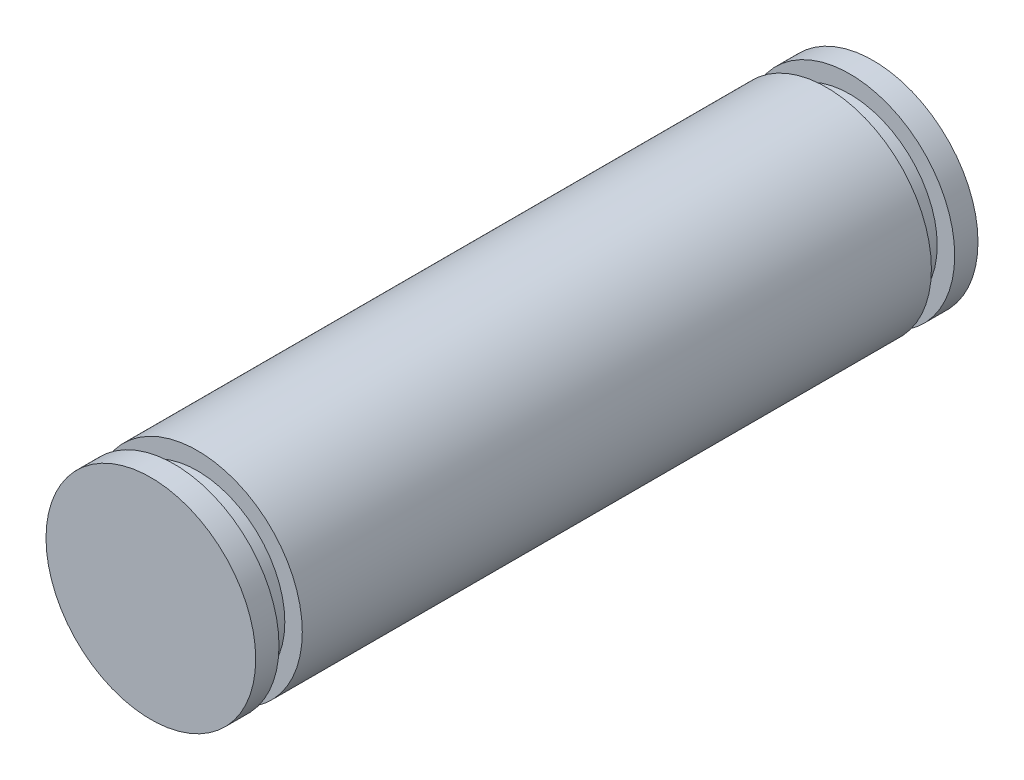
from build123d import *

# Parameters (mm, degrees)
ESQUISSE1_R      = 4.5
EXTRUSION1_DEPTH = 1
ESQUISSE2_R      = 3.75
EXTRUSION2_DEPTH = 1
ESQUISSE3_R      = 4.5
EXTRUSION3_DEPTH = 27
ESQUISSE4_R      = 3.75
EXTRUSION4_DEPTH = 1
ESQUISSE5_R      = 4.5
EXTRUSION5_DEPTH = 1


with BuildPart() as part:
    # Esquisse1 → Extrusion1 (new body)
    with BuildSketch(Plane.XY):
        Circle(ESQUISSE1_R)
    extrude(amount=EXTRUSION1_DEPTH)

    # Esquisse2 → Extrusion2 (add)
    with BuildSketch(Plane.XY.offset(1)):
        Circle(ESQUISSE2_R)
    extrude(amount=EXTRUSION2_DEPTH)

    # Esquisse3 → Extrusion3 (add)
    with BuildSketch(Plane.XY.offset(2)):
        Circle(ESQUISSE3_R)
    extrude(amount=EXTRUSION3_DEPTH)

    # Esquisse4 → Extrusion4 (add)
    with BuildSketch(Plane.XY.offset(29)):
        Circle(ESQUISSE4_R)
    extrude(amount=EXTRUSION4_DEPTH)

    # Esquisse5 → Extrusion5 (add)
    with BuildSketch(Plane.XY.offset(30)):
        Circle(ESQUISSE5_R)
    extrude(amount=EXTRUSION5_DEPTH)


solid = part.part
